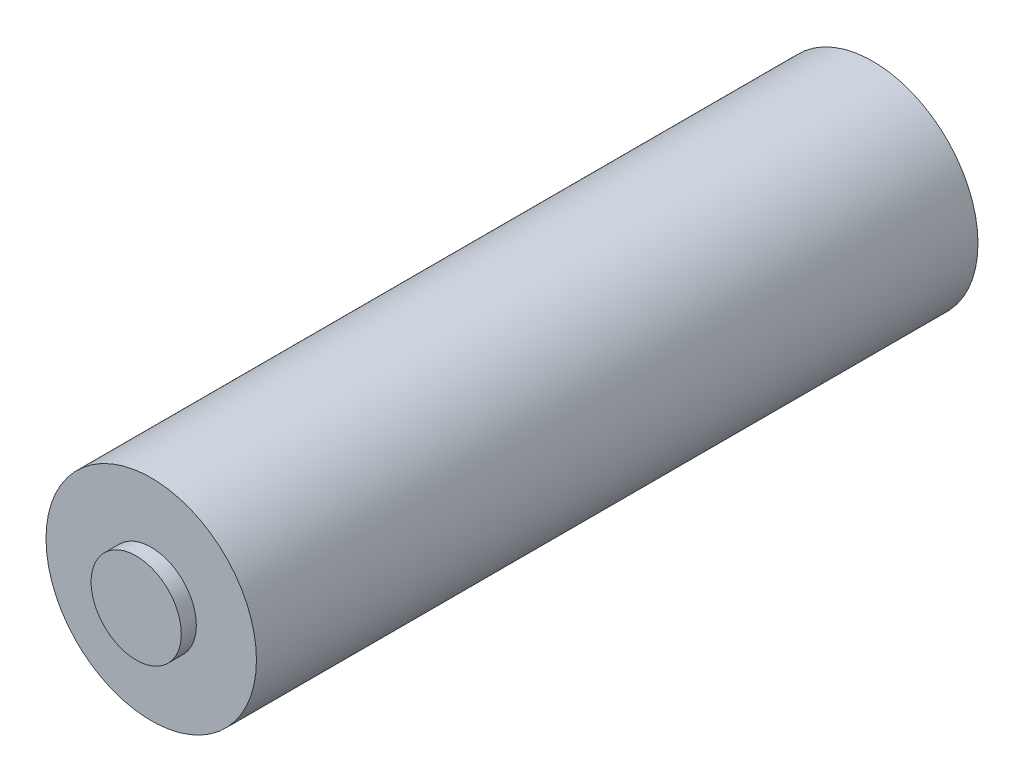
from build123d import *

# Parameters (mm, degrees)
ESQUISSE1_R      = 7
EXTRUSION1_DEPTH = 48
ESQUISSE2_R      = 3
EXTRUSION2_DEPTH = 1


with BuildPart() as part:
    # Esquisse1 → Extrusion1 (new body)
    with BuildSketch(Plane.XY):
        Circle(ESQUISSE1_R)
    extrude(amount=EXTRUSION1_DEPTH)

    # Esquisse2 → Extrusion2 (add)
    with BuildSketch(Plane.XY.offset(48)):
        Circle(ESQUISSE2_R)
    extrude(amount=EXTRUSION2_DEPTH)


solid = part.part
